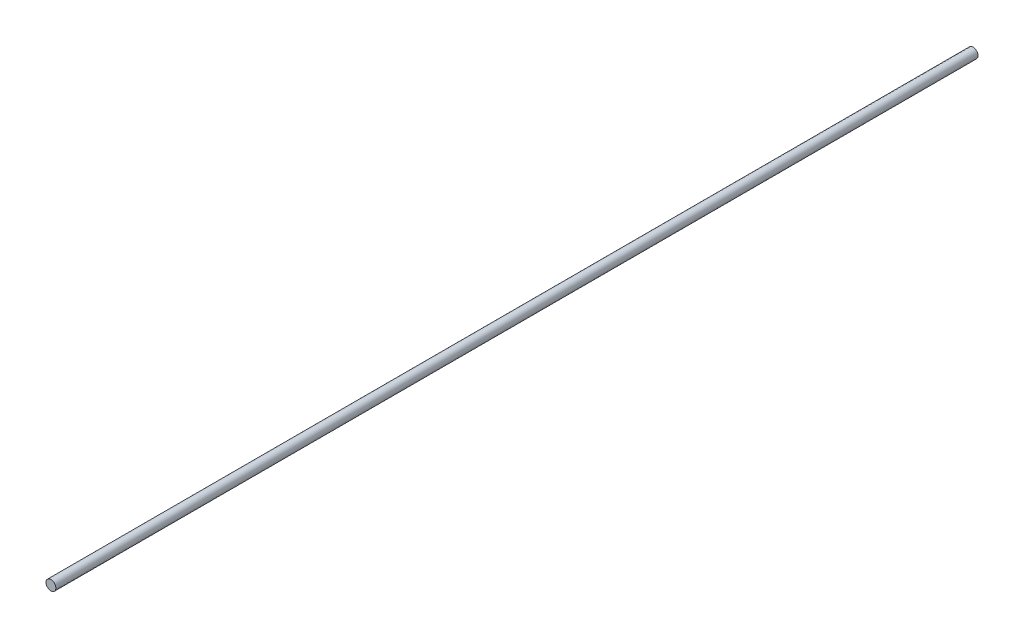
ISO-10303-21;
HEADER;
FILE_DESCRIPTION(('STEP AP214'),'2;1');
FILE_NAME('part.step','',(''),(''),'','','');
FILE_SCHEMA(('AUTOMOTIVE_DESIGN { 1 0 10303 214 1 1 1 1 }'));
ENDSEC;
DATA;
#1=APPLICATION_CONTEXT('core data for automotive mechanical design processes');
#2=APPLICATION_PROTOCOL_DEFINITION('international standard','automotive_design',2000,#1);
#3=PRODUCT_CONTEXT('',#1,'mechanical');
#4=PRODUCT('Part','Part','',(#3));
#5=PRODUCT_RELATED_PRODUCT_CATEGORY('part','',(#4));
#6=PRODUCT_DEFINITION_FORMATION('','',#4);
#7=PRODUCT_DEFINITION_CONTEXT('part definition',#1,'design');
#8=PRODUCT_DEFINITION('design','',#6,#7);
#9=PRODUCT_DEFINITION_SHAPE('','',#8);
#10=(LENGTH_UNIT() NAMED_UNIT(*) SI_UNIT(.MILLI.,.METRE.));
#11=(NAMED_UNIT(*) PLANE_ANGLE_UNIT() SI_UNIT($,.RADIAN.));
#12=(NAMED_UNIT(*) SI_UNIT($,.STERADIAN.) SOLID_ANGLE_UNIT());
#13=UNCERTAINTY_MEASURE_WITH_UNIT(LENGTH_MEASURE(1.E-05),#10,'distance_accuracy_value','');
#14=(GEOMETRIC_REPRESENTATION_CONTEXT(3) GLOBAL_UNCERTAINTY_ASSIGNED_CONTEXT((#13)) GLOBAL_UNIT_ASSIGNED_CONTEXT((#10,
#11,#12)) REPRESENTATION_CONTEXT('',''));
#15=CARTESIAN_POINT('',(0.,0.,0.));
#16=DIRECTION('',(0.,0.,1.));
#17=DIRECTION('',(1.,0.,0.));
#18=AXIS2_PLACEMENT_3D('',#15,#16,#17);
#19=CARTESIAN_POINT('',(0.,0.,-5600.));
#20=DIRECTION('',(0.,0.,1.));
#21=DIRECTION('',(1.,0.,0.));
#22=AXIS2_PLACEMENT_3D('',#19,#20,#21);
#23=CYLINDRICAL_SURFACE('',#22,30.);
#24=CARTESIAN_POINT('',(0.,0.,-5600.));
#25=DIRECTION('',(0.,0.,1.));
#26=DIRECTION('',(1.,0.,0.));
#27=AXIS2_PLACEMENT_3D('',#24,#25,#26);
#28=CIRCLE('',#27,30.);
#29=CARTESIAN_POINT('',(30.,0.,-5600.));
#30=VERTEX_POINT('',#29);
#31=EDGE_CURVE('E10',#30,#30,#28,.T.);
#32=ORIENTED_EDGE('',*,*,#31,.T.);
#33=EDGE_LOOP('',(#32));
#34=FACE_BOUND('',#33,.T.);
#35=CARTESIAN_POINT('',(0.,0.,0.));
#36=DIRECTION('',(0.,0.,1.));
#37=DIRECTION('',(1.,0.,0.));
#38=AXIS2_PLACEMENT_3D('',#35,#36,#37);
#39=CIRCLE('',#38,30.);
#40=CARTESIAN_POINT('',(30.,0.,0.));
#41=VERTEX_POINT('',#40);
#42=EDGE_CURVE('E40',#41,#41,#39,.T.);
#43=ORIENTED_EDGE('',*,*,#42,.F.);
#44=EDGE_LOOP('',(#43));
#45=FACE_BOUND('',#44,.T.);
#46=ADVANCED_FACE('F37',(#34,#45),#23,.T.);
#47=CARTESIAN_POINT('',(0.,0.,-5600.));
#48=DIRECTION('',(0.,0.,1.));
#49=DIRECTION('',(1.,0.,0.));
#50=AXIS2_PLACEMENT_3D('',#47,#48,#49);
#51=PLANE('',#50);
#52=ORIENTED_EDGE('',*,*,#31,.F.);
#53=EDGE_LOOP('',(#52));
#54=FACE_BOUND('',#53,.T.);
#55=ADVANCED_FACE('F54',(#54),#51,.F.);
#56=CARTESIAN_POINT('',(0.,0.,0.));
#57=DIRECTION('',(0.,0.,1.));
#58=DIRECTION('',(1.,0.,0.));
#59=AXIS2_PLACEMENT_3D('',#56,#57,#58);
#60=PLANE('',#59);
#61=ORIENTED_EDGE('',*,*,#42,.T.);
#62=EDGE_LOOP('',(#61));
#63=FACE_BOUND('',#62,.T.);
#64=ADVANCED_FACE('F51',(#63),#60,.T.);
#65=CLOSED_SHELL('',(#46,#55,#64));
#66=MANIFOLD_SOLID_BREP('B2',#65);
#67=ADVANCED_BREP_SHAPE_REPRESENTATION('',(#18,#66),#14);
#68=SHAPE_DEFINITION_REPRESENTATION(#9,#67);
ENDSEC;
END-ISO-10303-21;
